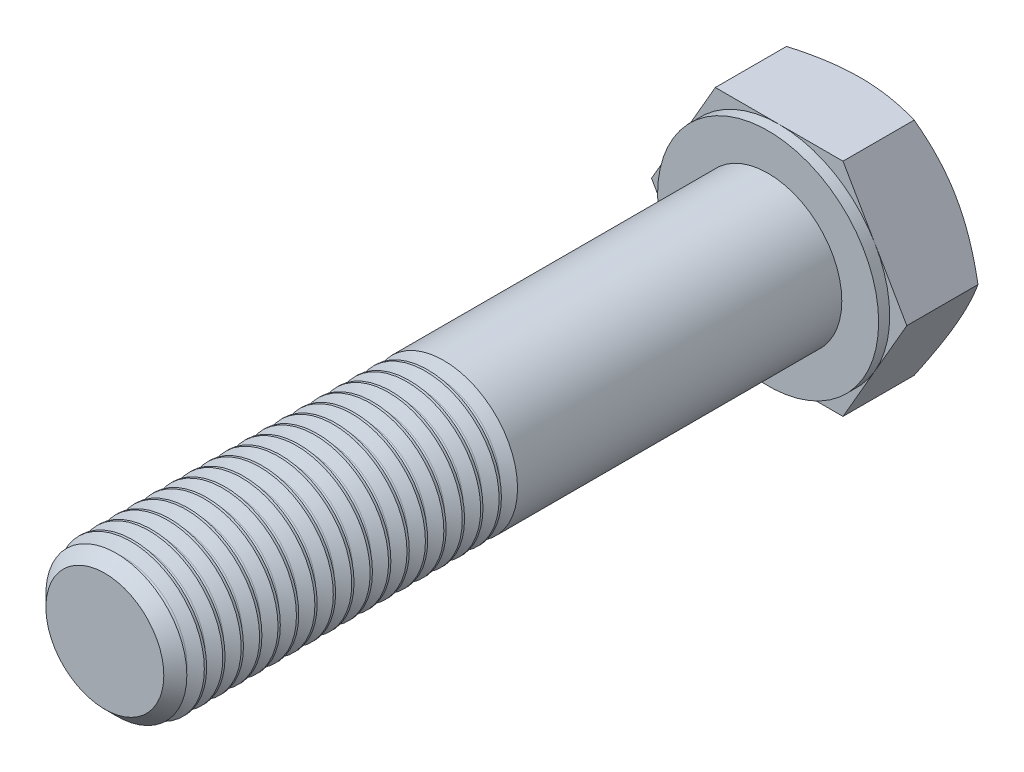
from build123d import *

# Parameters (mm, degrees)
SKETCH5_W               = 90
SKETCH5_H               = 10
THREAD_SIMPLE_COUNT     = 18
THREAD_SIMPLE_PITCH     = 2.5
SKETCH15_W              = 12.5
SKETCH15_H              = 20
SKETCH19_W              = 1.5
SKETCH19_H              = 5
SKETCH21_OUTSIDE_W      = 65.414
SKETCH21_OUTSIDE_H      = 65.414
CUT_PROFILE_OUTER_DEPTH = 95.339811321


with BuildPart() as part:
    # Sketch5 → body (revolve)
    with BuildSketch(Plane(origin=(0, 0, 0), x_dir=(0, 0, -1), z_dir=(1, 0, 0)), mode=Mode.PRIVATE) as body_sk:
        with Locations((45, 5)):
            Rectangle(SKETCH5_W, SKETCH5_H)
    revolve(body_sk.sketch.rotate(Axis((0, 0, 0), (0, 0, -1)), 90), axis=Axis((0, 0, 0), (0, 0, -1)))

    # Sketch11 → cut-chamfer-start (revolve, cut)
    with BuildSketch(Plane(origin=(0, 0, 0), x_dir=(0, 0, -1), z_dir=(1, 0, 0)), mode=Mode.PRIVATE) as cut_chamfer_start_sk:
        Polygon((0, -10), (0, -8), (2, -10), align=None)
    revolve(cut_chamfer_start_sk.sketch.rotate(Axis((0, 0, 0), (0, 0, -1)), 270), axis=Axis((0, 0, 0), (0, 0, -1)), mode=Mode.SUBTRACT)

    # Sketch8 → thread-single (revolve, cut)
    with BuildSketch(Plane(origin=(0, 0, 0), x_dir=(0, 0, -1), z_dir=(1, 0, 0)), mode=Mode.PRIVATE) as thread_single_sk:
        with BuildLine():
            Line((43.8125, -10), (46, -10))
            Line((46, -10), (45.140625, -8.511518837))
            ThreePointArc((45.140625, -8.511518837), (44.90625, -8.376202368), (44.671875, -8.511518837))
            Line((44.671875, -8.511518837), (43.8125, -10))
        make_face()
    thread_single = revolve(thread_single_sk.sketch.rotate(Axis((0, 0, 0), (0, 0, -1)), 270), axis=Axis((0, 0, 0), (0, 0, -1)), mode=Mode.SUBTRACT)

    # thread-simple: thread-single ×18
    with Locations(*[(0, 0, i * THREAD_SIMPLE_PITCH) for i in range(1, THREAD_SIMPLE_COUNT)]):
        add(thread_single, mode=Mode.SUBTRACT)

    # Sketch15 → body-head (revolve)
    with BuildSketch(Plane(origin=(0, 0, 0), x_dir=(0, 0, -1), z_dir=(1, 0, 0)), mode=Mode.PRIVATE) as body_head_sk:
        with Locations((96.25, -10)):
            Rectangle(SKETCH15_W, SKETCH15_H)
    revolve(body_head_sk.sketch.rotate(Axis((0, 0, -102.5), (0, 0, 1)), 270), axis=Axis((0, 0, -102.5), (0, 0, 1)))

    # Sketch19 → cut-head-profile (revolve, cut)
    with BuildSketch(Plane(origin=(0, 0, 0), x_dir=(0, 0, -1), z_dir=(1, 0, 0)), mode=Mode.PRIVATE) as cut_head_profile_sk:
        with Locations((90.75, -17.5)):
            Rectangle(SKETCH19_W, SKETCH19_H)
        Polygon((102.5, -20), (102.5, -15), (99.613248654, -20), align=None)
    revolve(cut_head_profile_sk.sketch.rotate(Axis((0, 0, -102.5), (0, 0, 1)), 270), axis=Axis((0, 0, -102.5), (0, 0, 1)), mode=Mode.SUBTRACT)

    # Sketch21 outside → cut-profile-outer (cut, through all)
    with BuildSketch(Plane.XY.offset(-90)):
        Rectangle(SKETCH21_OUTSIDE_W, SKETCH21_OUTSIDE_H)
        Polygon((17.320508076, 0), (8.660254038, 15), (-8.660254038, 15), (-17.320508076, 0), (-8.660254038, -15), (8.660254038, -15), align=None, mode=Mode.SUBTRACT)
    extrude(amount=-CUT_PROFILE_OUTER_DEPTH, mode=Mode.SUBTRACT)


solid = part.part
